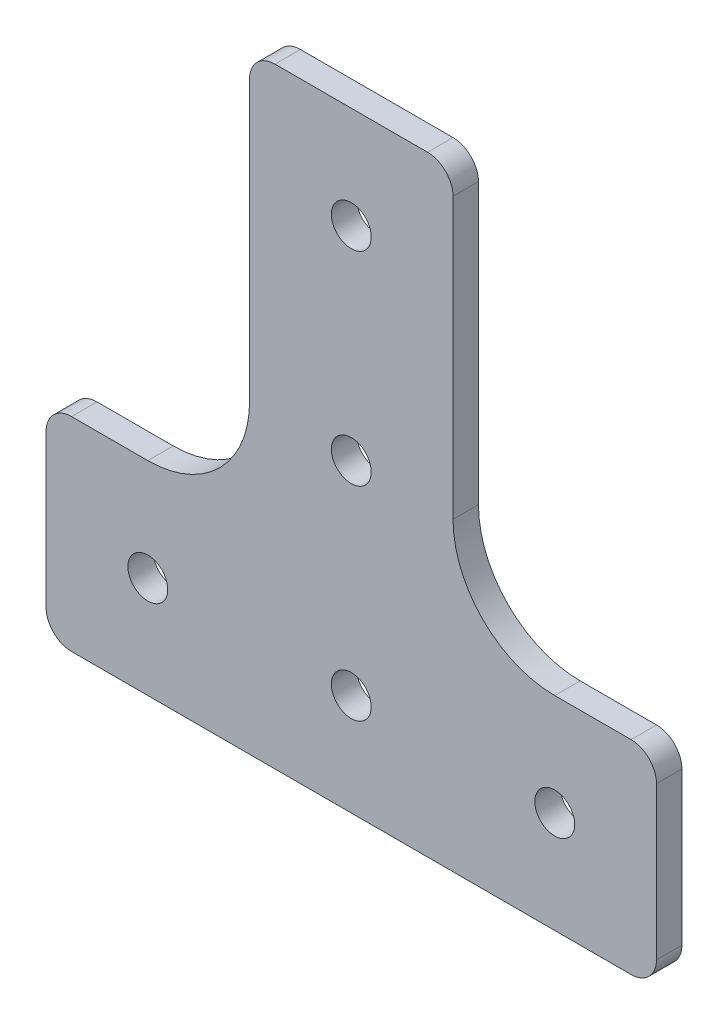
ISO-10303-21;
HEADER;
FILE_DESCRIPTION(('STEP AP214'),'2;1');
FILE_NAME('part.step','',(''),(''),'','','');
FILE_SCHEMA(('AUTOMOTIVE_DESIGN { 1 0 10303 214 1 1 1 1 }'));
ENDSEC;
DATA;
#1=APPLICATION_CONTEXT('core data for automotive mechanical design processes');
#2=APPLICATION_PROTOCOL_DEFINITION('international standard','automotive_design',2000,#1);
#3=PRODUCT_CONTEXT('',#1,'mechanical');
#4=PRODUCT('Part','Part','',(#3));
#5=PRODUCT_RELATED_PRODUCT_CATEGORY('part','',(#4));
#6=PRODUCT_DEFINITION_FORMATION('','',#4);
#7=PRODUCT_DEFINITION_CONTEXT('part definition',#1,'design');
#8=PRODUCT_DEFINITION('design','',#6,#7);
#9=PRODUCT_DEFINITION_SHAPE('','',#8);
#10=(LENGTH_UNIT() NAMED_UNIT(*) SI_UNIT(.MILLI.,.METRE.));
#11=(NAMED_UNIT(*) PLANE_ANGLE_UNIT() SI_UNIT($,.RADIAN.));
#12=(NAMED_UNIT(*) SI_UNIT($,.STERADIAN.) SOLID_ANGLE_UNIT());
#13=UNCERTAINTY_MEASURE_WITH_UNIT(LENGTH_MEASURE(1.E-05),#10,'distance_accuracy_value','');
#14=(GEOMETRIC_REPRESENTATION_CONTEXT(3) GLOBAL_UNCERTAINTY_ASSIGNED_CONTEXT((#13)) GLOBAL_UNIT_ASSIGNED_CONTEXT((#10,
#11,#12)) REPRESENTATION_CONTEXT('',''));
#15=CARTESIAN_POINT('',(0.,0.,0.));
#16=DIRECTION('',(0.,0.,1.));
#17=DIRECTION('',(1.,0.,0.));
#18=AXIS2_PLACEMENT_3D('',#15,#16,#17);
#19=CARTESIAN_POINT('',(-38.1,0.,3.175));
#20=DIRECTION('',(1.,0.,0.));
#21=DIRECTION('',(0.,1.,0.));
#22=AXIS2_PLACEMENT_3D('',#19,#20,#21);
#23=PLANE('',#22);
#24=DIRECTION('',(0.,-1.,0.));
#25=VECTOR('',#24,1.);
#26=CARTESIAN_POINT('',(-38.1,0.,0.));
#27=LINE('',#26,#25);
#28=CARTESIAN_POINT('',(-38.1,22.225,0.));
#29=VERTEX_POINT('',#28);
#30=CARTESIAN_POINT('',(-38.1,3.175,0.));
#31=VERTEX_POINT('',#30);
#32=EDGE_CURVE('E177',#29,#31,#27,.T.);
#33=ORIENTED_EDGE('',*,*,#32,.T.);
#34=DIRECTION('',(0.,0.,-1.));
#35=VECTOR('',#34,1.);
#36=CARTESIAN_POINT('',(-38.1,3.175,3.175));
#37=LINE('',#36,#35);
#38=CARTESIAN_POINT('',(-38.1,3.175,3.175));
#39=VERTEX_POINT('',#38);
#40=EDGE_CURVE('E156',#31,#39,#37,.F.);
#41=ORIENTED_EDGE('',*,*,#40,.T.);
#42=DIRECTION('',(0.,-1.,0.));
#43=VECTOR('',#42,1.);
#44=CARTESIAN_POINT('',(-38.1,0.,3.175));
#45=LINE('',#44,#43);
#46=CARTESIAN_POINT('',(-38.1,22.225,3.175));
#47=VERTEX_POINT('',#46);
#48=EDGE_CURVE('E197',#47,#39,#45,.T.);
#49=ORIENTED_EDGE('',*,*,#48,.F.);
#50=DIRECTION('',(0.,0.,-1.));
#51=VECTOR('',#50,1.);
#52=CARTESIAN_POINT('',(-38.1,22.225,3.175));
#53=LINE('',#52,#51);
#54=EDGE_CURVE('E160',#47,#29,#53,.T.);
#55=ORIENTED_EDGE('',*,*,#54,.T.);
#56=EDGE_LOOP('',(#33,#41,#49,#55));
#57=FACE_BOUND('',#56,.T.);
#58=ADVANCED_FACE('F38',(#57),#23,.F.);
#59=CARTESIAN_POINT('',(-38.1,0.,3.175));
#60=DIRECTION('',(0.,1.,0.));
#61=DIRECTION('',(-1.,0.,0.));
#62=AXIS2_PLACEMENT_3D('',#59,#60,#61);
#63=PLANE('',#62);
#64=DIRECTION('',(1.,0.,0.));
#65=VECTOR('',#64,1.);
#66=CARTESIAN_POINT('',(-38.1,0.,3.175));
#67=LINE('',#66,#65);
#68=CARTESIAN_POINT('',(-34.925,0.,3.175));
#69=VERTEX_POINT('',#68);
#70=CARTESIAN_POINT('',(34.925,0.,3.175));
#71=VERTEX_POINT('',#70);
#72=EDGE_CURVE('E170',#69,#71,#67,.T.);
#73=ORIENTED_EDGE('',*,*,#72,.F.);
#74=DIRECTION('',(0.,0.,-1.));
#75=VECTOR('',#74,1.);
#76=CARTESIAN_POINT('',(-34.925,0.,3.175));
#77=LINE('',#76,#75);
#78=CARTESIAN_POINT('',(-34.925,0.,0.));
#79=VERTEX_POINT('',#78);
#80=EDGE_CURVE('E155',#69,#79,#77,.T.);
#81=ORIENTED_EDGE('',*,*,#80,.T.);
#82=DIRECTION('',(1.,0.,0.));
#83=VECTOR('',#82,1.);
#84=CARTESIAN_POINT('',(-38.1,0.,0.));
#85=LINE('',#84,#83);
#86=CARTESIAN_POINT('',(34.925,0.,0.));
#87=VERTEX_POINT('',#86);
#88=EDGE_CURVE('E167',#79,#87,#85,.T.);
#89=ORIENTED_EDGE('',*,*,#88,.T.);
#90=DIRECTION('',(0.,0.,-1.));
#91=VECTOR('',#90,1.);
#92=CARTESIAN_POINT('',(34.925,0.,3.175));
#93=LINE('',#92,#91);
#94=EDGE_CURVE('E172',#87,#71,#93,.F.);
#95=ORIENTED_EDGE('',*,*,#94,.T.);
#96=EDGE_LOOP('',(#73,#81,#89,#95));
#97=FACE_BOUND('',#96,.T.);
#98=ADVANCED_FACE('F166',(#97),#63,.F.);
#99=CARTESIAN_POINT('',(38.1,25.4,3.175));
#100=DIRECTION('',(-1.,0.,0.));
#101=DIRECTION('',(0.,0.,1.));
#102=AXIS2_PLACEMENT_3D('',#99,#100,#101);
#103=PLANE('',#102);
#104=DIRECTION('',(0.,1.,0.));
#105=VECTOR('',#104,1.);
#106=CARTESIAN_POINT('',(38.1,25.4,3.175));
#107=LINE('',#106,#105);
#108=CARTESIAN_POINT('',(38.1,3.17500000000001,3.175));
#109=VERTEX_POINT('',#108);
#110=CARTESIAN_POINT('',(38.1,22.225,3.175));
#111=VERTEX_POINT('',#110);
#112=EDGE_CURVE('E292',#109,#111,#107,.T.);
#113=ORIENTED_EDGE('',*,*,#112,.F.);
#114=DIRECTION('',(0.,0.,-1.));
#115=VECTOR('',#114,1.);
#116=CARTESIAN_POINT('',(38.1,3.17500000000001,3.175));
#117=LINE('',#116,#115);
#118=CARTESIAN_POINT('',(38.1,3.17500000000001,0.));
#119=VERTEX_POINT('',#118);
#120=EDGE_CURVE('E227',#109,#119,#117,.T.);
#121=ORIENTED_EDGE('',*,*,#120,.T.);
#122=DIRECTION('',(0.,1.,0.));
#123=VECTOR('',#122,1.);
#124=CARTESIAN_POINT('',(38.1,25.4,0.));
#125=LINE('',#124,#123);
#126=CARTESIAN_POINT('',(38.1,22.225,0.));
#127=VERTEX_POINT('',#126);
#128=EDGE_CURVE('E176',#119,#127,#125,.T.);
#129=ORIENTED_EDGE('',*,*,#128,.T.);
#130=DIRECTION('',(0.,0.,-1.));
#131=VECTOR('',#130,1.);
#132=CARTESIAN_POINT('',(38.1,22.225,3.175));
#133=LINE('',#132,#131);
#134=EDGE_CURVE('E225',#127,#111,#133,.F.);
#135=ORIENTED_EDGE('',*,*,#134,.T.);
#136=EDGE_LOOP('',(#113,#121,#129,#135));
#137=FACE_BOUND('',#136,.T.);
#138=ADVANCED_FACE('F289',(#137),#103,.F.);
#139=CARTESIAN_POINT('',(12.7,25.4,3.175));
#140=DIRECTION('',(0.,-1.,0.));
#141=DIRECTION('',(1.,0.,0.));
#142=AXIS2_PLACEMENT_3D('',#139,#140,#141);
#143=PLANE('',#142);
#144=DIRECTION('',(-1.,0.,0.));
#145=VECTOR('',#144,1.);
#146=CARTESIAN_POINT('',(12.7,25.4,0.));
#147=LINE('',#146,#145);
#148=CARTESIAN_POINT('',(34.925,25.4,0.));
#149=VERTEX_POINT('',#148);
#150=CARTESIAN_POINT('',(25.4,25.4,0.));
#151=VERTEX_POINT('',#150);
#152=EDGE_CURVE('E180',#149,#151,#147,.T.);
#153=ORIENTED_EDGE('',*,*,#152,.T.);
#154=DIRECTION('',(0.,0.,-1.));
#155=VECTOR('',#154,1.);
#156=CARTESIAN_POINT('',(25.4,25.4,3.175));
#157=LINE('',#156,#155);
#158=CARTESIAN_POINT('',(25.4,25.4,3.175));
#159=VERTEX_POINT('',#158);
#160=EDGE_CURVE('E250',#151,#159,#157,.F.);
#161=ORIENTED_EDGE('',*,*,#160,.T.);
#162=DIRECTION('',(-1.,0.,0.));
#163=VECTOR('',#162,1.);
#164=CARTESIAN_POINT('',(12.7,25.4,3.175));
#165=LINE('',#164,#163);
#166=CARTESIAN_POINT('',(34.925,25.4,3.175));
#167=VERTEX_POINT('',#166);
#168=EDGE_CURVE('E267',#167,#159,#165,.T.);
#169=ORIENTED_EDGE('',*,*,#168,.F.);
#170=DIRECTION('',(0.,0.,-1.));
#171=VECTOR('',#170,1.);
#172=CARTESIAN_POINT('',(34.925,25.4,3.175));
#173=LINE('',#172,#171);
#174=EDGE_CURVE('E230',#167,#149,#173,.T.);
#175=ORIENTED_EDGE('',*,*,#174,.T.);
#176=EDGE_LOOP('',(#153,#161,#169,#175));
#177=FACE_BOUND('',#176,.T.);
#178=ADVANCED_FACE('F281',(#177),#143,.F.);
#179=CARTESIAN_POINT('',(12.7,76.2,3.175));
#180=DIRECTION('',(-1.,0.,0.));
#181=DIRECTION('',(0.,0.,1.));
#182=AXIS2_PLACEMENT_3D('',#179,#180,#181);
#183=PLANE('',#182);
#184=DIRECTION('',(0.,1.,0.));
#185=VECTOR('',#184,1.);
#186=CARTESIAN_POINT('',(12.7,76.2,3.175));
#187=LINE('',#186,#185);
#188=CARTESIAN_POINT('',(12.7,38.1,3.175));
#189=VERTEX_POINT('',#188);
#190=CARTESIAN_POINT('',(12.7,73.025,3.175));
#191=VERTEX_POINT('',#190);
#192=EDGE_CURVE('E265',#189,#191,#187,.T.);
#193=ORIENTED_EDGE('',*,*,#192,.F.);
#194=DIRECTION('',(0.,0.,-1.));
#195=VECTOR('',#194,1.);
#196=CARTESIAN_POINT('',(12.7,38.1,0.));
#197=LINE('',#196,#195);
#198=CARTESIAN_POINT('',(12.7,38.1,0.));
#199=VERTEX_POINT('',#198);
#200=EDGE_CURVE('E247',#189,#199,#197,.T.);
#201=ORIENTED_EDGE('',*,*,#200,.T.);
#202=DIRECTION('',(0.,1.,0.));
#203=VECTOR('',#202,1.);
#204=CARTESIAN_POINT('',(12.7,76.2,0.));
#205=LINE('',#204,#203);
#206=CARTESIAN_POINT('',(12.7,73.025,0.));
#207=VERTEX_POINT('',#206);
#208=EDGE_CURVE('E188',#199,#207,#205,.T.);
#209=ORIENTED_EDGE('',*,*,#208,.T.);
#210=DIRECTION('',(0.,0.,-1.));
#211=VECTOR('',#210,1.);
#212=CARTESIAN_POINT('',(12.7,73.025,3.175));
#213=LINE('',#212,#211);
#214=EDGE_CURVE('E238',#207,#191,#213,.F.);
#215=ORIENTED_EDGE('',*,*,#214,.T.);
#216=EDGE_LOOP('',(#193,#201,#209,#215));
#217=FACE_BOUND('',#216,.T.);
#218=ADVANCED_FACE('F272',(#217),#183,.F.);
#219=CARTESIAN_POINT('',(-12.7,76.2,3.175));
#220=DIRECTION('',(0.,-1.,0.));
#221=DIRECTION('',(0.,0.,-1.));
#222=AXIS2_PLACEMENT_3D('',#219,#220,#221);
#223=PLANE('',#222);
#224=DIRECTION('',(-1.,0.,0.));
#225=VECTOR('',#224,1.);
#226=CARTESIAN_POINT('',(-12.7,76.2,3.175));
#227=LINE('',#226,#225);
#228=CARTESIAN_POINT('',(9.525,76.2,3.175));
#229=VERTEX_POINT('',#228);
#230=CARTESIAN_POINT('',(-9.525,76.2,3.175));
#231=VERTEX_POINT('',#230);
#232=EDGE_CURVE('E276',#229,#231,#227,.T.);
#233=ORIENTED_EDGE('',*,*,#232,.F.);
#234=DIRECTION('',(0.,0.,-1.));
#235=VECTOR('',#234,1.);
#236=CARTESIAN_POINT('',(9.525,76.2,3.175));
#237=LINE('',#236,#235);
#238=CARTESIAN_POINT('',(9.525,76.2,0.));
#239=VERTEX_POINT('',#238);
#240=EDGE_CURVE('E235',#229,#239,#237,.T.);
#241=ORIENTED_EDGE('',*,*,#240,.T.);
#242=DIRECTION('',(-1.,0.,0.));
#243=VECTOR('',#242,1.);
#244=CARTESIAN_POINT('',(-12.7,76.2,0.));
#245=LINE('',#244,#243);
#246=CARTESIAN_POINT('',(-9.525,76.2,0.));
#247=VERTEX_POINT('',#246);
#248=EDGE_CURVE('E190',#239,#247,#245,.T.);
#249=ORIENTED_EDGE('',*,*,#248,.T.);
#250=DIRECTION('',(0.,0.,-1.));
#251=VECTOR('',#250,1.);
#252=CARTESIAN_POINT('',(-9.525,76.2,3.175));
#253=LINE('',#252,#251);
#254=EDGE_CURVE('E233',#247,#231,#253,.F.);
#255=ORIENTED_EDGE('',*,*,#254,.T.);
#256=EDGE_LOOP('',(#233,#241,#249,#255));
#257=FACE_BOUND('',#256,.T.);
#258=ADVANCED_FACE('F373',(#257),#223,.F.);
#259=CARTESIAN_POINT('',(-12.7,25.4,3.175));
#260=DIRECTION('',(1.,0.,0.));
#261=DIRECTION('',(0.,0.,-1.));
#262=AXIS2_PLACEMENT_3D('',#259,#260,#261);
#263=PLANE('',#262);
#264=DIRECTION('',(0.,-1.,0.));
#265=VECTOR('',#264,1.);
#266=CARTESIAN_POINT('',(-12.7,25.4,0.));
#267=LINE('',#266,#265);
#268=CARTESIAN_POINT('',(-12.7,73.025,0.));
#269=VERTEX_POINT('',#268);
#270=CARTESIAN_POINT('',(-12.7,38.1,0.));
#271=VERTEX_POINT('',#270);
#272=EDGE_CURVE('E193',#269,#271,#267,.T.);
#273=ORIENTED_EDGE('',*,*,#272,.T.);
#274=DIRECTION('',(0.,0.,-1.));
#275=VECTOR('',#274,1.);
#276=CARTESIAN_POINT('',(-12.7,38.1,3.175));
#277=LINE('',#276,#275);
#278=CARTESIAN_POINT('',(-12.7,38.1,3.175));
#279=VERTEX_POINT('',#278);
#280=EDGE_CURVE('E59',#271,#279,#277,.F.);
#281=ORIENTED_EDGE('',*,*,#280,.T.);
#282=DIRECTION('',(0.,-1.,0.));
#283=VECTOR('',#282,1.);
#284=CARTESIAN_POINT('',(-12.7,25.4,3.175));
#285=LINE('',#284,#283);
#286=CARTESIAN_POINT('',(-12.7,73.025,3.175));
#287=VERTEX_POINT('',#286);
#288=EDGE_CURVE('E304',#287,#279,#285,.T.);
#289=ORIENTED_EDGE('',*,*,#288,.F.);
#290=DIRECTION('',(0.,0.,-1.));
#291=VECTOR('',#290,1.);
#292=CARTESIAN_POINT('',(-12.7,73.025,3.175));
#293=LINE('',#292,#291);
#294=EDGE_CURVE('E241',#287,#269,#293,.T.);
#295=ORIENTED_EDGE('',*,*,#294,.T.);
#296=EDGE_LOOP('',(#273,#281,#289,#295));
#297=FACE_BOUND('',#296,.T.);
#298=ADVANCED_FACE('F370',(#297),#263,.F.);
#299=CARTESIAN_POINT('',(-38.1,25.4,3.175));
#300=DIRECTION('',(0.,-1.,0.));
#301=DIRECTION('',(0.,0.,-1.));
#302=AXIS2_PLACEMENT_3D('',#299,#300,#301);
#303=PLANE('',#302);
#304=DIRECTION('',(-1.,0.,0.));
#305=VECTOR('',#304,1.);
#306=CARTESIAN_POINT('',(-38.1,25.4,3.175));
#307=LINE('',#306,#305);
#308=CARTESIAN_POINT('',(-25.4,25.4,3.175));
#309=VERTEX_POINT('',#308);
#310=CARTESIAN_POINT('',(-34.925,25.4,3.175));
#311=VERTEX_POINT('',#310);
#312=EDGE_CURVE('E198',#309,#311,#307,.T.);
#313=ORIENTED_EDGE('',*,*,#312,.F.);
#314=DIRECTION('',(0.,0.,-1.));
#315=VECTOR('',#314,1.);
#316=CARTESIAN_POINT('',(-25.4,25.4,0.));
#317=LINE('',#316,#315);
#318=CARTESIAN_POINT('',(-25.4,25.4,0.));
#319=VERTEX_POINT('',#318);
#320=EDGE_CURVE('E252',#309,#319,#317,.T.);
#321=ORIENTED_EDGE('',*,*,#320,.T.);
#322=DIRECTION('',(-1.,0.,0.));
#323=VECTOR('',#322,1.);
#324=CARTESIAN_POINT('',(-38.1,25.4,0.));
#325=LINE('',#324,#323);
#326=CARTESIAN_POINT('',(-34.925,25.4,0.));
#327=VERTEX_POINT('',#326);
#328=EDGE_CURVE('E195',#319,#327,#325,.T.);
#329=ORIENTED_EDGE('',*,*,#328,.T.);
#330=DIRECTION('',(0.,0.,-1.));
#331=VECTOR('',#330,1.);
#332=CARTESIAN_POINT('',(-34.925,25.4,3.175));
#333=LINE('',#332,#331);
#334=EDGE_CURVE('E244',#327,#311,#333,.F.);
#335=ORIENTED_EDGE('',*,*,#334,.T.);
#336=EDGE_LOOP('',(#313,#321,#329,#335));
#337=FACE_BOUND('',#336,.T.);
#338=ADVANCED_FACE('F312',(#337),#303,.F.);
#339=CARTESIAN_POINT('',(0.,0.,3.175));
#340=DIRECTION('',(0.,0.,-1.));
#341=DIRECTION('',(-1.,0.,0.));
#342=AXIS2_PLACEMENT_3D('',#339,#340,#341);
#343=PLANE('',#342);
#344=CARTESIAN_POINT('',(0.,63.5,3.175));
#345=DIRECTION('',(0.,0.,1.));
#346=DIRECTION('',(1.,0.,0.));
#347=AXIS2_PLACEMENT_3D('',#344,#345,#346);
#348=CIRCLE('',#347,2.4892);
#349=CARTESIAN_POINT('',(2.4892,63.5,3.175));
#350=VERTEX_POINT('',#349);
#351=EDGE_CURVE('E495',#350,#350,#348,.T.);
#352=ORIENTED_EDGE('',*,*,#351,.F.);
#353=EDGE_LOOP('',(#352));
#354=FACE_BOUND('',#353,.T.);
#355=CARTESIAN_POINT('',(0.,38.1,3.175));
#356=DIRECTION('',(0.,0.,1.));
#357=DIRECTION('',(1.,0.,0.));
#358=AXIS2_PLACEMENT_3D('',#355,#356,#357);
#359=CIRCLE('',#358,2.4892);
#360=CARTESIAN_POINT('',(2.4892,38.1,3.175));
#361=VERTEX_POINT('',#360);
#362=EDGE_CURVE('E497',#361,#361,#359,.T.);
#363=ORIENTED_EDGE('',*,*,#362,.F.);
#364=EDGE_LOOP('',(#363));
#365=FACE_BOUND('',#364,.T.);
#366=CARTESIAN_POINT('',(-25.4,12.7,3.175));
#367=DIRECTION('',(0.,0.,1.));
#368=DIRECTION('',(1.,0.,0.));
#369=AXIS2_PLACEMENT_3D('',#366,#367,#368);
#370=CIRCLE('',#369,2.4892);
#371=CARTESIAN_POINT('',(-22.9108,12.7,3.175));
#372=VERTEX_POINT('',#371);
#373=EDGE_CURVE('E503',#372,#372,#370,.T.);
#374=ORIENTED_EDGE('',*,*,#373,.F.);
#375=EDGE_LOOP('',(#374));
#376=FACE_BOUND('',#375,.T.);
#377=CARTESIAN_POINT('',(25.4,12.7,3.175));
#378=DIRECTION('',(0.,0.,1.));
#379=DIRECTION('',(1.,0.,0.));
#380=AXIS2_PLACEMENT_3D('',#377,#378,#379);
#381=CIRCLE('',#380,2.4892);
#382=CARTESIAN_POINT('',(27.8892,12.7,3.175));
#383=VERTEX_POINT('',#382);
#384=EDGE_CURVE('E509',#383,#383,#381,.T.);
#385=ORIENTED_EDGE('',*,*,#384,.F.);
#386=EDGE_LOOP('',(#385));
#387=FACE_BOUND('',#386,.T.);
#388=CARTESIAN_POINT('',(0.,12.7,3.175));
#389=DIRECTION('',(0.,0.,1.));
#390=DIRECTION('',(1.,0.,0.));
#391=AXIS2_PLACEMENT_3D('',#388,#389,#390);
#392=CIRCLE('',#391,2.4892);
#393=CARTESIAN_POINT('',(2.4892,12.7,3.175));
#394=VERTEX_POINT('',#393);
#395=EDGE_CURVE('E515',#394,#394,#392,.T.);
#396=ORIENTED_EDGE('',*,*,#395,.F.);
#397=EDGE_LOOP('',(#396));
#398=FACE_BOUND('',#397,.T.);
#399=ORIENTED_EDGE('',*,*,#48,.T.);
#400=CARTESIAN_POINT('',(-34.925,3.175,3.175));
#401=DIRECTION('',(0.,0.,-1.));
#402=DIRECTION('',(-1.,0.,0.));
#403=AXIS2_PLACEMENT_3D('',#400,#401,#402);
#404=CIRCLE('',#403,3.175);
#405=EDGE_CURVE('E223',#39,#69,#404,.F.);
#406=ORIENTED_EDGE('',*,*,#405,.T.);
#407=ORIENTED_EDGE('',*,*,#72,.T.);
#408=CARTESIAN_POINT('',(34.925,3.17500000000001,3.175));
#409=DIRECTION('',(0.,0.,-1.));
#410=DIRECTION('',(-1.,0.,0.));
#411=AXIS2_PLACEMENT_3D('',#408,#409,#410);
#412=CIRCLE('',#411,3.175);
#413=EDGE_CURVE('E221',#71,#109,#412,.F.);
#414=ORIENTED_EDGE('',*,*,#413,.T.);
#415=ORIENTED_EDGE('',*,*,#112,.T.);
#416=CARTESIAN_POINT('',(34.925,22.225,3.175));
#417=DIRECTION('',(0.,0.,-1.));
#418=DIRECTION('',(-1.,0.,0.));
#419=AXIS2_PLACEMENT_3D('',#416,#417,#418);
#420=CIRCLE('',#419,3.175);
#421=EDGE_CURVE('E219',#111,#167,#420,.F.);
#422=ORIENTED_EDGE('',*,*,#421,.T.);
#423=ORIENTED_EDGE('',*,*,#168,.T.);
#424=CARTESIAN_POINT('',(25.4,38.1,3.175));
#425=DIRECTION('',(0.,0.,-1.));
#426=DIRECTION('',(-1.,0.,0.));
#427=AXIS2_PLACEMENT_3D('',#424,#425,#426);
#428=CIRCLE('',#427,12.7);
#429=EDGE_CURVE('E258',#159,#189,#428,.T.);
#430=ORIENTED_EDGE('',*,*,#429,.T.);
#431=ORIENTED_EDGE('',*,*,#192,.T.);
#432=CARTESIAN_POINT('',(9.525,73.025,3.175));
#433=DIRECTION('',(0.,0.,-1.));
#434=DIRECTION('',(-1.,0.,0.));
#435=AXIS2_PLACEMENT_3D('',#432,#433,#434);
#436=CIRCLE('',#435,3.175);
#437=EDGE_CURVE('E217',#191,#229,#436,.F.);
#438=ORIENTED_EDGE('',*,*,#437,.T.);
#439=ORIENTED_EDGE('',*,*,#232,.T.);
#440=CARTESIAN_POINT('',(-9.525,73.025,3.175));
#441=DIRECTION('',(0.,0.,-1.));
#442=DIRECTION('',(-1.,0.,0.));
#443=AXIS2_PLACEMENT_3D('',#440,#441,#442);
#444=CIRCLE('',#443,3.175);
#445=EDGE_CURVE('E215',#231,#287,#444,.F.);
#446=ORIENTED_EDGE('',*,*,#445,.T.);
#447=ORIENTED_EDGE('',*,*,#288,.T.);
#448=CARTESIAN_POINT('',(-25.4,38.1,3.175));
#449=DIRECTION('',(0.,0.,-1.));
#450=DIRECTION('',(-1.,0.,0.));
#451=AXIS2_PLACEMENT_3D('',#448,#449,#450);
#452=CIRCLE('',#451,12.7);
#453=EDGE_CURVE('E11',#279,#309,#452,.T.);
#454=ORIENTED_EDGE('',*,*,#453,.T.);
#455=ORIENTED_EDGE('',*,*,#312,.T.);
#456=CARTESIAN_POINT('',(-34.925,22.225,3.175));
#457=DIRECTION('',(0.,0.,-1.));
#458=DIRECTION('',(-1.,0.,0.));
#459=AXIS2_PLACEMENT_3D('',#456,#457,#458);
#460=CIRCLE('',#459,3.175);
#461=EDGE_CURVE('E213',#311,#47,#460,.F.);
#462=ORIENTED_EDGE('',*,*,#461,.T.);
#463=EDGE_LOOP('',(#399,#406,#407,#414,#415,#422,#423,#430,#431,#438,#439,#446,#447,#454,#455,#462));
#464=FACE_BOUND('',#463,.T.);
#465=ADVANCED_FACE('F264',(#354,#365,#376,#387,#398,#464),#343,.F.);
#466=CARTESIAN_POINT('',(0.,0.,0.));
#467=DIRECTION('',(0.,0.,-1.));
#468=DIRECTION('',(-1.,0.,0.));
#469=AXIS2_PLACEMENT_3D('',#466,#467,#468);
#470=PLANE('',#469);
#471=CARTESIAN_POINT('',(0.,63.5,0.));
#472=DIRECTION('',(0.,0.,1.));
#473=DIRECTION('',(1.,0.,0.));
#474=AXIS2_PLACEMENT_3D('',#471,#472,#473);
#475=CIRCLE('',#474,2.4892);
#476=CARTESIAN_POINT('',(2.4892,63.5,0.));
#477=VERTEX_POINT('',#476);
#478=EDGE_CURVE('E492',#477,#477,#475,.T.);
#479=ORIENTED_EDGE('',*,*,#478,.T.);
#480=EDGE_LOOP('',(#479));
#481=FACE_BOUND('',#480,.T.);
#482=CARTESIAN_POINT('',(0.,38.1,0.));
#483=DIRECTION('',(0.,0.,1.));
#484=DIRECTION('',(1.,0.,0.));
#485=AXIS2_PLACEMENT_3D('',#482,#483,#484);
#486=CIRCLE('',#485,2.4892);
#487=CARTESIAN_POINT('',(2.4892,38.1,0.));
#488=VERTEX_POINT('',#487);
#489=EDGE_CURVE('E500',#488,#488,#486,.T.);
#490=ORIENTED_EDGE('',*,*,#489,.T.);
#491=EDGE_LOOP('',(#490));
#492=FACE_BOUND('',#491,.T.);
#493=CARTESIAN_POINT('',(-25.4,12.7,0.));
#494=DIRECTION('',(0.,0.,1.));
#495=DIRECTION('',(1.,0.,0.));
#496=AXIS2_PLACEMENT_3D('',#493,#494,#495);
#497=CIRCLE('',#496,2.4892);
#498=CARTESIAN_POINT('',(-22.9108,12.7,0.));
#499=VERTEX_POINT('',#498);
#500=EDGE_CURVE('E506',#499,#499,#497,.T.);
#501=ORIENTED_EDGE('',*,*,#500,.T.);
#502=EDGE_LOOP('',(#501));
#503=FACE_BOUND('',#502,.T.);
#504=CARTESIAN_POINT('',(25.4,12.7,0.));
#505=DIRECTION('',(0.,0.,1.));
#506=DIRECTION('',(1.,0.,0.));
#507=AXIS2_PLACEMENT_3D('',#504,#505,#506);
#508=CIRCLE('',#507,2.4892);
#509=CARTESIAN_POINT('',(27.8892,12.7,0.));
#510=VERTEX_POINT('',#509);
#511=EDGE_CURVE('E512',#510,#510,#508,.T.);
#512=ORIENTED_EDGE('',*,*,#511,.T.);
#513=EDGE_LOOP('',(#512));
#514=FACE_BOUND('',#513,.T.);
#515=CARTESIAN_POINT('',(0.,12.7,0.));
#516=DIRECTION('',(0.,0.,1.));
#517=DIRECTION('',(1.,0.,0.));
#518=AXIS2_PLACEMENT_3D('',#515,#516,#517);
#519=CIRCLE('',#518,2.4892);
#520=CARTESIAN_POINT('',(2.4892,12.7,0.));
#521=VERTEX_POINT('',#520);
#522=EDGE_CURVE('E182',#521,#521,#519,.T.);
#523=ORIENTED_EDGE('',*,*,#522,.T.);
#524=EDGE_LOOP('',(#523));
#525=FACE_BOUND('',#524,.T.);
#526=ORIENTED_EDGE('',*,*,#88,.F.);
#527=CARTESIAN_POINT('',(-34.925,3.175,0.));
#528=DIRECTION('',(0.,0.,-1.));
#529=DIRECTION('',(-1.,0.,0.));
#530=AXIS2_PLACEMENT_3D('',#527,#528,#529);
#531=CIRCLE('',#530,3.175);
#532=EDGE_CURVE('E151',#79,#31,#531,.T.);
#533=ORIENTED_EDGE('',*,*,#532,.T.);
#534=ORIENTED_EDGE('',*,*,#32,.F.);
#535=CARTESIAN_POINT('',(-34.925,22.225,0.));
#536=DIRECTION('',(0.,0.,-1.));
#537=DIRECTION('',(-1.,0.,0.));
#538=AXIS2_PLACEMENT_3D('',#535,#536,#537);
#539=CIRCLE('',#538,3.175);
#540=EDGE_CURVE('E171',#29,#327,#539,.T.);
#541=ORIENTED_EDGE('',*,*,#540,.T.);
#542=ORIENTED_EDGE('',*,*,#328,.F.);
#543=CARTESIAN_POINT('',(-25.4,38.1,0.));
#544=DIRECTION('',(0.,0.,-1.));
#545=DIRECTION('',(-1.,0.,0.));
#546=AXIS2_PLACEMENT_3D('',#543,#544,#545);
#547=CIRCLE('',#546,12.7);
#548=EDGE_CURVE('E46',#319,#271,#547,.F.);
#549=ORIENTED_EDGE('',*,*,#548,.T.);
#550=ORIENTED_EDGE('',*,*,#272,.F.);
#551=CARTESIAN_POINT('',(-9.525,73.025,0.));
#552=DIRECTION('',(0.,0.,-1.));
#553=DIRECTION('',(-1.,0.,0.));
#554=AXIS2_PLACEMENT_3D('',#551,#552,#553);
#555=CIRCLE('',#554,3.175);
#556=EDGE_CURVE('E202',#269,#247,#555,.T.);
#557=ORIENTED_EDGE('',*,*,#556,.T.);
#558=ORIENTED_EDGE('',*,*,#248,.F.);
#559=CARTESIAN_POINT('',(9.525,73.025,0.));
#560=DIRECTION('',(0.,0.,-1.));
#561=DIRECTION('',(-1.,0.,0.));
#562=AXIS2_PLACEMENT_3D('',#559,#560,#561);
#563=CIRCLE('',#562,3.175);
#564=EDGE_CURVE('E204',#239,#207,#563,.T.);
#565=ORIENTED_EDGE('',*,*,#564,.T.);
#566=ORIENTED_EDGE('',*,*,#208,.F.);
#567=CARTESIAN_POINT('',(25.4,38.1,0.));
#568=DIRECTION('',(0.,0.,-1.));
#569=DIRECTION('',(-1.,0.,0.));
#570=AXIS2_PLACEMENT_3D('',#567,#568,#569);
#571=CIRCLE('',#570,12.7);
#572=EDGE_CURVE('E256',#199,#151,#571,.F.);
#573=ORIENTED_EDGE('',*,*,#572,.T.);
#574=ORIENTED_EDGE('',*,*,#152,.F.);
#575=CARTESIAN_POINT('',(34.925,22.225,0.));
#576=DIRECTION('',(0.,0.,-1.));
#577=DIRECTION('',(-1.,0.,0.));
#578=AXIS2_PLACEMENT_3D('',#575,#576,#577);
#579=CIRCLE('',#578,3.175);
#580=EDGE_CURVE('E207',#149,#127,#579,.T.);
#581=ORIENTED_EDGE('',*,*,#580,.T.);
#582=ORIENTED_EDGE('',*,*,#128,.F.);
#583=CARTESIAN_POINT('',(34.925,3.17500000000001,0.));
#584=DIRECTION('',(0.,0.,-1.));
#585=DIRECTION('',(-1.,0.,0.));
#586=AXIS2_PLACEMENT_3D('',#583,#584,#585);
#587=CIRCLE('',#586,3.175);
#588=EDGE_CURVE('E161',#119,#87,#587,.T.);
#589=ORIENTED_EDGE('',*,*,#588,.T.);
#590=EDGE_LOOP('',(#526,#533,#534,#541,#542,#549,#550,#557,#558,#565,#566,#573,#574,#581,#582,#589));
#591=FACE_BOUND('',#590,.T.);
#592=ADVANCED_FACE('F174',(#481,#492,#503,#514,#525,#591),#470,.T.);
#593=CARTESIAN_POINT('',(-34.925,3.175,3.175));
#594=DIRECTION('',(0.,0.,-1.));
#595=DIRECTION('',(-1.,0.,0.));
#596=AXIS2_PLACEMENT_3D('',#593,#594,#595);
#597=CYLINDRICAL_SURFACE('',#596,3.175);
#598=ORIENTED_EDGE('',*,*,#405,.F.);
#599=ORIENTED_EDGE('',*,*,#40,.F.);
#600=ORIENTED_EDGE('',*,*,#532,.F.);
#601=ORIENTED_EDGE('',*,*,#80,.F.);
#602=EDGE_LOOP('',(#598,#599,#600,#601));
#603=FACE_BOUND('',#602,.T.);
#604=ADVANCED_FACE('F154',(#603),#597,.T.);
#605=CARTESIAN_POINT('',(34.925,3.17500000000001,3.175));
#606=DIRECTION('',(0.,0.,-1.));
#607=DIRECTION('',(-1.,0.,0.));
#608=AXIS2_PLACEMENT_3D('',#605,#606,#607);
#609=CYLINDRICAL_SURFACE('',#608,3.175);
#610=ORIENTED_EDGE('',*,*,#413,.F.);
#611=ORIENTED_EDGE('',*,*,#94,.F.);
#612=ORIENTED_EDGE('',*,*,#588,.F.);
#613=ORIENTED_EDGE('',*,*,#120,.F.);
#614=EDGE_LOOP('',(#610,#611,#612,#613));
#615=FACE_BOUND('',#614,.T.);
#616=ADVANCED_FACE('F295',(#615),#609,.T.);
#617=CARTESIAN_POINT('',(34.925,22.225,3.175));
#618=DIRECTION('',(0.,0.,-1.));
#619=DIRECTION('',(-1.,0.,0.));
#620=AXIS2_PLACEMENT_3D('',#617,#618,#619);
#621=CYLINDRICAL_SURFACE('',#620,3.175);
#622=ORIENTED_EDGE('',*,*,#421,.F.);
#623=ORIENTED_EDGE('',*,*,#134,.F.);
#624=ORIENTED_EDGE('',*,*,#580,.F.);
#625=ORIENTED_EDGE('',*,*,#174,.F.);
#626=EDGE_LOOP('',(#622,#623,#624,#625));
#627=FACE_BOUND('',#626,.T.);
#628=ADVANCED_FACE('F285',(#627),#621,.T.);
#629=CARTESIAN_POINT('',(9.525,73.025,3.175));
#630=DIRECTION('',(0.,0.,-1.));
#631=DIRECTION('',(-1.,0.,0.));
#632=AXIS2_PLACEMENT_3D('',#629,#630,#631);
#633=CYLINDRICAL_SURFACE('',#632,3.175);
#634=ORIENTED_EDGE('',*,*,#437,.F.);
#635=ORIENTED_EDGE('',*,*,#214,.F.);
#636=ORIENTED_EDGE('',*,*,#564,.F.);
#637=ORIENTED_EDGE('',*,*,#240,.F.);
#638=EDGE_LOOP('',(#634,#635,#636,#637));
#639=FACE_BOUND('',#638,.T.);
#640=ADVANCED_FACE('F331',(#639),#633,.T.);
#641=CARTESIAN_POINT('',(-9.525,73.025,3.175));
#642=DIRECTION('',(0.,0.,-1.));
#643=DIRECTION('',(-1.,0.,0.));
#644=AXIS2_PLACEMENT_3D('',#641,#642,#643);
#645=CYLINDRICAL_SURFACE('',#644,3.175);
#646=ORIENTED_EDGE('',*,*,#445,.F.);
#647=ORIENTED_EDGE('',*,*,#254,.F.);
#648=ORIENTED_EDGE('',*,*,#556,.F.);
#649=ORIENTED_EDGE('',*,*,#294,.F.);
#650=EDGE_LOOP('',(#646,#647,#648,#649));
#651=FACE_BOUND('',#650,.T.);
#652=ADVANCED_FACE('F334',(#651),#645,.T.);
#653=CARTESIAN_POINT('',(-34.925,22.225,3.175));
#654=DIRECTION('',(0.,0.,-1.));
#655=DIRECTION('',(-1.,0.,0.));
#656=AXIS2_PLACEMENT_3D('',#653,#654,#655);
#657=CYLINDRICAL_SURFACE('',#656,3.175);
#658=ORIENTED_EDGE('',*,*,#461,.F.);
#659=ORIENTED_EDGE('',*,*,#334,.F.);
#660=ORIENTED_EDGE('',*,*,#540,.F.);
#661=ORIENTED_EDGE('',*,*,#54,.F.);
#662=EDGE_LOOP('',(#658,#659,#660,#661));
#663=FACE_BOUND('',#662,.T.);
#664=ADVANCED_FACE('F315',(#663),#657,.T.);
#665=CARTESIAN_POINT('',(25.4,38.1,3.175));
#666=DIRECTION('',(0.,0.,1.));
#667=DIRECTION('',(1.,0.,0.));
#668=AXIS2_PLACEMENT_3D('',#665,#666,#667);
#669=CYLINDRICAL_SURFACE('',#668,12.7);
#670=ORIENTED_EDGE('',*,*,#429,.F.);
#671=ORIENTED_EDGE('',*,*,#160,.F.);
#672=ORIENTED_EDGE('',*,*,#572,.F.);
#673=ORIENTED_EDGE('',*,*,#200,.F.);
#674=EDGE_LOOP('',(#670,#671,#672,#673));
#675=FACE_BOUND('',#674,.T.);
#676=ADVANCED_FACE('F278',(#675),#669,.F.);
#677=CARTESIAN_POINT('',(-25.4,38.1,3.175));
#678=DIRECTION('',(0.,0.,1.));
#679=DIRECTION('',(1.,0.,0.));
#680=AXIS2_PLACEMENT_3D('',#677,#678,#679);
#681=CYLINDRICAL_SURFACE('',#680,12.7);
#682=ORIENTED_EDGE('',*,*,#453,.F.);
#683=ORIENTED_EDGE('',*,*,#280,.F.);
#684=ORIENTED_EDGE('',*,*,#548,.F.);
#685=ORIENTED_EDGE('',*,*,#320,.F.);
#686=EDGE_LOOP('',(#682,#683,#684,#685));
#687=FACE_BOUND('',#686,.T.);
#688=ADVANCED_FACE('F40',(#687),#681,.F.);
#689=CARTESIAN_POINT('',(0.,12.7,0.));
#690=DIRECTION('',(0.,0.,1.));
#691=DIRECTION('',(1.,0.,0.));
#692=AXIS2_PLACEMENT_3D('',#689,#690,#691);
#693=CYLINDRICAL_SURFACE('',#692,2.4892);
#694=ORIENTED_EDGE('',*,*,#522,.F.);
#695=EDGE_LOOP('',(#694));
#696=FACE_BOUND('',#695,.T.);
#697=ORIENTED_EDGE('',*,*,#395,.T.);
#698=EDGE_LOOP('',(#697));
#699=FACE_BOUND('',#698,.T.);
#700=ADVANCED_FACE('F344',(#696,#699),#693,.F.);
#701=CARTESIAN_POINT('',(25.4,12.7,0.));
#702=DIRECTION('',(0.,0.,1.));
#703=DIRECTION('',(1.,0.,0.));
#704=AXIS2_PLACEMENT_3D('',#701,#702,#703);
#705=CYLINDRICAL_SURFACE('',#704,2.4892);
#706=ORIENTED_EDGE('',*,*,#511,.F.);
#707=EDGE_LOOP('',(#706));
#708=FACE_BOUND('',#707,.T.);
#709=ORIENTED_EDGE('',*,*,#384,.T.);
#710=EDGE_LOOP('',(#709));
#711=FACE_BOUND('',#710,.T.);
#712=ADVANCED_FACE('F349',(#708,#711),#705,.F.);
#713=CARTESIAN_POINT('',(-25.4,12.7,0.));
#714=DIRECTION('',(0.,0.,1.));
#715=DIRECTION('',(1.,0.,0.));
#716=AXIS2_PLACEMENT_3D('',#713,#714,#715);
#717=CYLINDRICAL_SURFACE('',#716,2.4892);
#718=ORIENTED_EDGE('',*,*,#500,.F.);
#719=EDGE_LOOP('',(#718));
#720=FACE_BOUND('',#719,.T.);
#721=ORIENTED_EDGE('',*,*,#373,.T.);
#722=EDGE_LOOP('',(#721));
#723=FACE_BOUND('',#722,.T.);
#724=ADVANCED_FACE('F355',(#720,#723),#717,.F.);
#725=CARTESIAN_POINT('',(0.,38.1,0.));
#726=DIRECTION('',(0.,0.,1.));
#727=DIRECTION('',(1.,0.,0.));
#728=AXIS2_PLACEMENT_3D('',#725,#726,#727);
#729=CYLINDRICAL_SURFACE('',#728,2.4892);
#730=ORIENTED_EDGE('',*,*,#489,.F.);
#731=EDGE_LOOP('',(#730));
#732=FACE_BOUND('',#731,.T.);
#733=ORIENTED_EDGE('',*,*,#362,.T.);
#734=EDGE_LOOP('',(#733));
#735=FACE_BOUND('',#734,.T.);
#736=ADVANCED_FACE('F466',(#732,#735),#729,.F.);
#737=CARTESIAN_POINT('',(0.,63.5,0.));
#738=DIRECTION('',(0.,0.,1.));
#739=DIRECTION('',(1.,0.,0.));
#740=AXIS2_PLACEMENT_3D('',#737,#738,#739);
#741=CYLINDRICAL_SURFACE('',#740,2.4892);
#742=ORIENTED_EDGE('',*,*,#478,.F.);
#743=EDGE_LOOP('',(#742));
#744=FACE_BOUND('',#743,.T.);
#745=ORIENTED_EDGE('',*,*,#351,.T.);
#746=EDGE_LOOP('',(#745));
#747=FACE_BOUND('',#746,.T.);
#748=ADVANCED_FACE('F474',(#744,#747),#741,.F.);
#749=CLOSED_SHELL('',(#58,#98,#138,#178,#218,#258,#298,#338,#465,#592,#604,#616,#628,#640,#652,
#664,#676,#688,#700,#712,#724,#736,#748));
#750=MANIFOLD_SOLID_BREP('B2',#749);
#751=ADVANCED_BREP_SHAPE_REPRESENTATION('',(#18,#750),#14);
#752=SHAPE_DEFINITION_REPRESENTATION(#9,#751);
ENDSEC;
END-ISO-10303-21;
